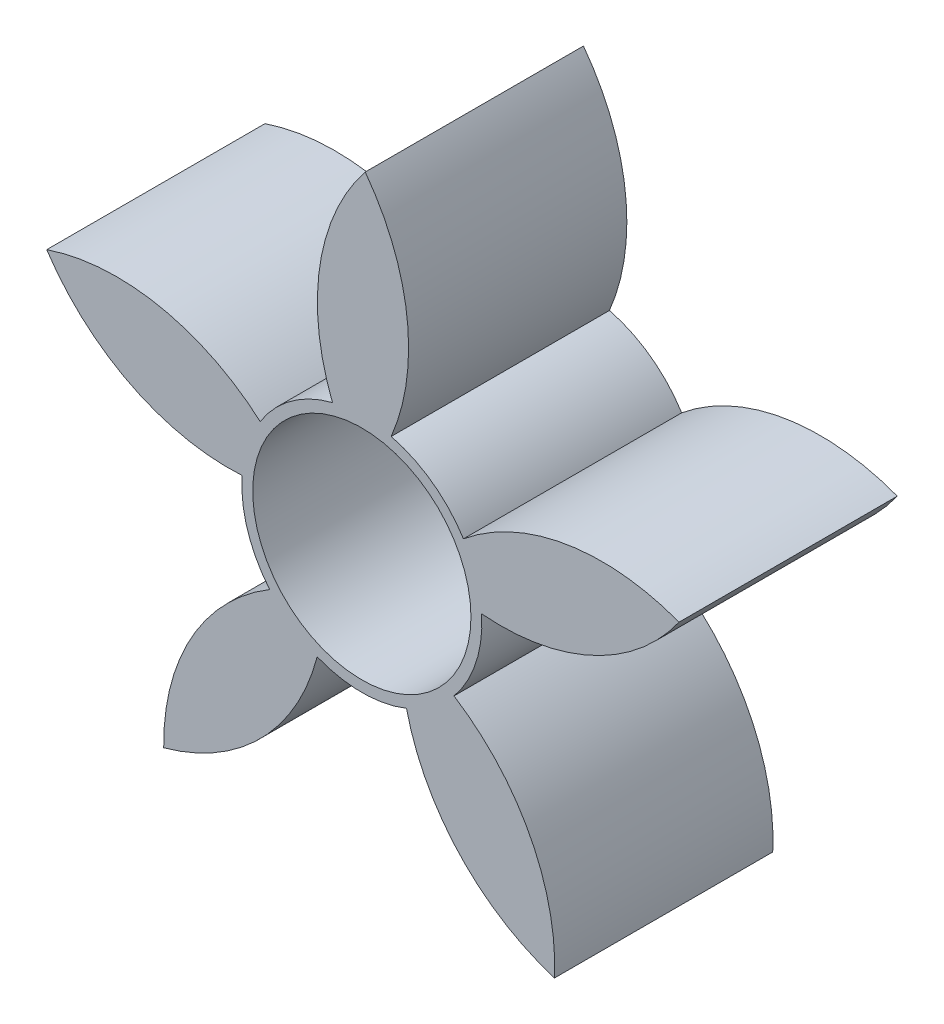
ISO-10303-21;
HEADER;
FILE_DESCRIPTION(('STEP AP214'),'2;1');
FILE_NAME('part.step','',(''),(''),'','','');
FILE_SCHEMA(('AUTOMOTIVE_DESIGN { 1 0 10303 214 1 1 1 1 }'));
ENDSEC;
DATA;
#1=APPLICATION_CONTEXT('core data for automotive mechanical design processes');
#2=APPLICATION_PROTOCOL_DEFINITION('international standard','automotive_design',2000,#1);
#3=PRODUCT_CONTEXT('',#1,'mechanical');
#4=PRODUCT('Part','Part','',(#3));
#5=PRODUCT_RELATED_PRODUCT_CATEGORY('part','',(#4));
#6=PRODUCT_DEFINITION_FORMATION('','',#4);
#7=PRODUCT_DEFINITION_CONTEXT('part definition',#1,'design');
#8=PRODUCT_DEFINITION('design','',#6,#7);
#9=PRODUCT_DEFINITION_SHAPE('','',#8);
#10=(LENGTH_UNIT() NAMED_UNIT(*) SI_UNIT(.MILLI.,.METRE.));
#11=(NAMED_UNIT(*) PLANE_ANGLE_UNIT() SI_UNIT($,.RADIAN.));
#12=(NAMED_UNIT(*) SI_UNIT($,.STERADIAN.) SOLID_ANGLE_UNIT());
#13=UNCERTAINTY_MEASURE_WITH_UNIT(LENGTH_MEASURE(1.E-05),#10,'distance_accuracy_value','');
#14=(GEOMETRIC_REPRESENTATION_CONTEXT(3) GLOBAL_UNCERTAINTY_ASSIGNED_CONTEXT((#13)) GLOBAL_UNIT_ASSIGNED_CONTEXT((#10,
#11,#12)) REPRESENTATION_CONTEXT('',''));
#15=CARTESIAN_POINT('',(0.,0.,0.));
#16=DIRECTION('',(0.,0.,1.));
#17=DIRECTION('',(1.,0.,0.));
#18=AXIS2_PLACEMENT_3D('',#15,#16,#17);
#19=CARTESIAN_POINT('',(0.136113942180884,23.1575869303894,25.4));
#20=DIRECTION('',(0.,0.,1.));
#21=DIRECTION('',(1.,0.,0.));
#22=AXIS2_PLACEMENT_3D('',#19,#20,#21);
#23=PLANE('',#22);
#24=CARTESIAN_POINT('',(-19.9560370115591,23.4904947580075,25.4));
#25=DIRECTION('',(0.,0.,1.));
#26=DIRECTION('',(1.,0.,0.));
#27=AXIS2_PLACEMENT_3D('',#24,#25,#26);
#28=CIRCLE('',#27,25.4);
#29=CARTESIAN_POINT('',(3.41625583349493,13.5458516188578,25.4));
#30=VERTEX_POINT('',#29);
#31=CARTESIAN_POINT('',(0.393488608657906,38.6910476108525,25.4));
#32=VERTEX_POINT('',#31);
#33=EDGE_CURVE('E200',#30,#32,#28,.T.);
#34=ORIENTED_EDGE('',*,*,#33,.T.);
#35=CARTESIAN_POINT('',(20.2282648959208,22.8246791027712,25.4));
#36=DIRECTION('',(0.,0.,1.));
#37=DIRECTION('',(1.,0.,0.));
#38=AXIS2_PLACEMENT_3D('',#35,#36,#37);
#39=CIRCLE('',#38,25.4);
#40=CARTESIAN_POINT('',(-3.41625583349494,13.5458516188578,25.4));
#41=VERTEX_POINT('',#40);
#42=EDGE_CURVE('E113',#32,#41,#39,.T.);
#43=ORIENTED_EDGE('',*,*,#42,.T.);
#44=CARTESIAN_POINT('',(0.,0.,25.4));
#45=DIRECTION('',(0.,0.,1.));
#46=DIRECTION('',(1.,0.,0.));
#47=AXIS2_PLACEMENT_3D('',#44,#45,#46);
#48=CIRCLE('',#47,13.97);
#49=CARTESIAN_POINT('',(-11.8271893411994,7.43495072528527,25.4));
#50=VERTEX_POINT('',#49);
#51=EDGE_CURVE('E236',#41,#50,#48,.T.);
#52=ORIENTED_EDGE('',*,*,#51,.T.);
#53=CARTESIAN_POINT('',(-28.5075426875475,-11.7203569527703,25.4));
#54=DIRECTION('',(0.,0.,1.));
#55=DIRECTION('',(1.,0.,0.));
#56=AXIS2_PLACEMENT_3D('',#53,#54,#55);
#57=CIRCLE('',#56,25.4);
#58=CARTESIAN_POINT('',(-36.6757782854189,12.3304211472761,25.4));
#59=VERTEX_POINT('',#58);
#60=EDGE_CURVE('E255',#50,#59,#57,.T.);
#61=ORIENTED_EDGE('',*,*,#60,.T.);
#62=CARTESIAN_POINT('',(-15.4566821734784,26.2914368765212,25.4));
#63=DIRECTION('',(0.,0.,1.));
#64=DIRECTION('',(1.,0.,0.));
#65=AXIS2_PLACEMENT_3D('',#62,#63,#64);
#66=CIRCLE('',#65,25.4);
#67=CARTESIAN_POINT('',(-13.9385515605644,0.936845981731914,25.4));
#68=VERTEX_POINT('',#67);
#69=EDGE_CURVE('E252',#59,#68,#66,.T.);
#70=ORIENTED_EDGE('',*,*,#69,.T.);
#71=CARTESIAN_POINT('',(0.,0.,25.4));
#72=DIRECTION('',(0.,0.,1.));
#73=DIRECTION('',(1.,0.,0.));
#74=AXIS2_PLACEMENT_3D('',#71,#72,#73);
#75=CIRCLE('',#74,13.97);
#76=CARTESIAN_POINT('',(-10.7258608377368,-8.95079936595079,25.4));
#77=VERTEX_POINT('',#76);
#78=EDGE_CURVE('E254',#68,#77,#75,.T.);
#79=ORIENTED_EDGE('',*,*,#78,.T.);
#80=CARTESIAN_POINT('',(2.33740669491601,-30.7340737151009,25.4));
#81=DIRECTION('',(0.,0.,1.));
#82=DIRECTION('',(1.,0.,0.));
#83=AXIS2_PLACEMENT_3D('',#80,#81,#82);
#84=CIRCLE('',#83,25.4);
#85=CARTESIAN_POINT('',(-23.0603661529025,-31.0704282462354,25.4));
#86=VERTEX_POINT('',#85);
#87=EDGE_CURVE('E257',#77,#86,#84,.T.);
#88=ORIENTED_EDGE('',*,*,#87,.T.);
#89=CARTESIAN_POINT('',(-29.7810198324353,-6.57567750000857,25.4));
#90=DIRECTION('',(0.,0.,1.));
#91=DIRECTION('',(1.,0.,0.));
#92=AXIS2_PLACEMENT_3D('',#89,#90,#91);
#93=CIRCLE('',#92,25.4);
#94=CARTESIAN_POINT('',(-5.19824278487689,-12.9668489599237,25.4));
#95=VERTEX_POINT('',#94);
#96=EDGE_CURVE('E263',#86,#95,#93,.T.);
#97=ORIENTED_EDGE('',*,*,#96,.T.);
#98=CARTESIAN_POINT('',(0.,0.,25.4));
#99=DIRECTION('',(0.,0.,1.));
#100=DIRECTION('',(1.,0.,0.));
#101=AXIS2_PLACEMENT_3D('',#98,#99,#100);
#102=CIRCLE('',#101,13.97);
#103=CARTESIAN_POINT('',(5.1982427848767,-12.9668489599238,25.4));
#104=VERTEX_POINT('',#103);
#105=EDGE_CURVE('E265',#95,#104,#102,.T.);
#106=ORIENTED_EDGE('',*,*,#105,.T.);
#107=CARTESIAN_POINT('',(29.9521394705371,-7.27434521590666,25.4));
#108=DIRECTION('',(0.,0.,1.));
#109=DIRECTION('',(1.,0.,0.));
#110=AXIS2_PLACEMENT_3D('',#107,#108,#109);
#111=CIRCLE('',#110,25.4);
#112=CARTESIAN_POINT('',(22.4236882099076,-31.5330018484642,25.4));
#113=VERTEX_POINT('',#112);
#114=EDGE_CURVE('E267',#104,#113,#111,.T.);
#115=ORIENTED_EDGE('',*,*,#114,.T.);
#116=CARTESIAN_POINT('',(-2.94900030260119,-30.3554290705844,25.4));
#117=DIRECTION('',(0.,0.,1.));
#118=DIRECTION('',(1.,0.,0.));
#119=AXIS2_PLACEMENT_3D('',#116,#117,#118);
#120=CIRCLE('',#119,25.4);
#121=CARTESIAN_POINT('',(10.7258608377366,-8.95079936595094,25.4));
#122=VERTEX_POINT('',#121);
#123=EDGE_CURVE('E269',#113,#122,#120,.T.);
#124=ORIENTED_EDGE('',*,*,#123,.T.);
#125=CARTESIAN_POINT('',(0.,0.,25.4));
#126=DIRECTION('',(0.,0.,1.));
#127=DIRECTION('',(1.,0.,0.));
#128=AXIS2_PLACEMENT_3D('',#125,#126,#127);
#129=CIRCLE('',#128,13.97);
#130=CARTESIAN_POINT('',(13.9385515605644,0.936845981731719,25.4));
#131=VERTEX_POINT('',#130);
#132=EDGE_CURVE('E153',#122,#131,#129,.T.);
#133=ORIENTED_EDGE('',*,*,#132,.T.);
#134=CARTESIAN_POINT('',(16.1740335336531,26.2382811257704,25.4));
#135=DIRECTION('',(0.,0.,1.));
#136=DIRECTION('',(1.,0.,0.));
#137=AXIS2_PLACEMENT_3D('',#134,#135,#136);
#138=CIRCLE('',#137,25.4);
#139=CARTESIAN_POINT('',(36.9189676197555,11.5819613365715,25.4));
#140=VERTEX_POINT('',#139);
#141=EDGE_CURVE('E147',#131,#140,#138,.T.);
#142=ORIENTED_EDGE('',*,*,#141,.T.);
#143=CARTESIAN_POINT('',(27.9584374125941,-12.1850094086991,25.4));
#144=DIRECTION('',(0.,0.,1.));
#145=DIRECTION('',(1.,0.,0.));
#146=AXIS2_PLACEMENT_3D('',#143,#144,#145);
#147=CIRCLE('',#146,25.4);
#148=CARTESIAN_POINT('',(11.8271893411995,7.4349507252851,25.4));
#149=VERTEX_POINT('',#148);
#150=EDGE_CURVE('E151',#140,#149,#147,.T.);
#151=ORIENTED_EDGE('',*,*,#150,.T.);
#152=CARTESIAN_POINT('',(0.,0.,25.4));
#153=DIRECTION('',(0.,0.,1.));
#154=DIRECTION('',(1.,0.,0.));
#155=AXIS2_PLACEMENT_3D('',#152,#153,#154);
#156=CIRCLE('',#155,13.97);
#157=EDGE_CURVE('E49',#149,#30,#156,.T.);
#158=ORIENTED_EDGE('',*,*,#157,.T.);
#159=EDGE_LOOP('',(#34,#43,#52,#61,#70,#79,#88,#97,#106,#115,#124,#133,#142,#151,#158));
#160=FACE_BOUND('',#159,.T.);
#161=CARTESIAN_POINT('',(0.,0.,25.4));
#162=DIRECTION('',(0.,0.,1.));
#163=DIRECTION('',(1.,0.,0.));
#164=AXIS2_PLACEMENT_3D('',#161,#162,#163);
#165=CIRCLE('',#164,12.7);
#166=CARTESIAN_POINT('',(12.7,0.,25.4));
#167=VERTEX_POINT('',#166);
#168=EDGE_CURVE('E175',#167,#167,#165,.T.);
#169=ORIENTED_EDGE('',*,*,#168,.F.);
#170=EDGE_LOOP('',(#169));
#171=FACE_BOUND('',#170,.T.);
#172=ADVANCED_FACE('F32',(#160,#171),#23,.T.);
#173=CARTESIAN_POINT('',(0.136113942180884,23.1575869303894,0.));
#174=DIRECTION('',(0.,0.,1.));
#175=DIRECTION('',(1.,0.,0.));
#176=AXIS2_PLACEMENT_3D('',#173,#174,#175);
#177=PLANE('',#176);
#178=CARTESIAN_POINT('',(-19.9560370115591,23.4904947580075,0.));
#179=DIRECTION('',(0.,0.,1.));
#180=DIRECTION('',(1.,0.,0.));
#181=AXIS2_PLACEMENT_3D('',#178,#179,#180);
#182=CIRCLE('',#181,25.4);
#183=CARTESIAN_POINT('',(3.41625583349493,13.5458516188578,0.));
#184=VERTEX_POINT('',#183);
#185=CARTESIAN_POINT('',(0.393488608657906,38.6910476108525,0.));
#186=VERTEX_POINT('',#185);
#187=EDGE_CURVE('E171',#184,#186,#182,.T.);
#188=ORIENTED_EDGE('',*,*,#187,.F.);
#189=CARTESIAN_POINT('',(0.,0.,0.));
#190=DIRECTION('',(0.,0.,1.));
#191=DIRECTION('',(1.,0.,0.));
#192=AXIS2_PLACEMENT_3D('',#189,#190,#191);
#193=CIRCLE('',#192,13.97);
#194=CARTESIAN_POINT('',(11.8271893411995,7.4349507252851,0.));
#195=VERTEX_POINT('',#194);
#196=EDGE_CURVE('E105',#195,#184,#193,.T.);
#197=ORIENTED_EDGE('',*,*,#196,.F.);
#198=CARTESIAN_POINT('',(27.9584374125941,-12.1850094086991,0.));
#199=DIRECTION('',(0.,0.,1.));
#200=DIRECTION('',(1.,0.,0.));
#201=AXIS2_PLACEMENT_3D('',#198,#199,#200);
#202=CIRCLE('',#201,25.4);
#203=CARTESIAN_POINT('',(36.9189676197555,11.5819613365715,0.));
#204=VERTEX_POINT('',#203);
#205=EDGE_CURVE('E99',#204,#195,#202,.T.);
#206=ORIENTED_EDGE('',*,*,#205,.F.);
#207=CARTESIAN_POINT('',(16.1740335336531,26.2382811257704,0.));
#208=DIRECTION('',(0.,0.,1.));
#209=DIRECTION('',(1.,0.,0.));
#210=AXIS2_PLACEMENT_3D('',#207,#208,#209);
#211=CIRCLE('',#210,25.4);
#212=CARTESIAN_POINT('',(13.9385515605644,0.936845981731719,0.));
#213=VERTEX_POINT('',#212);
#214=EDGE_CURVE('E161',#213,#204,#211,.T.);
#215=ORIENTED_EDGE('',*,*,#214,.F.);
#216=CARTESIAN_POINT('',(0.,0.,0.));
#217=DIRECTION('',(0.,0.,1.));
#218=DIRECTION('',(1.,0.,0.));
#219=AXIS2_PLACEMENT_3D('',#216,#217,#218);
#220=CIRCLE('',#219,13.97);
#221=CARTESIAN_POINT('',(10.7258608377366,-8.95079936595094,0.));
#222=VERTEX_POINT('',#221);
#223=EDGE_CURVE('E195',#222,#213,#220,.T.);
#224=ORIENTED_EDGE('',*,*,#223,.F.);
#225=CARTESIAN_POINT('',(-2.94900030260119,-30.3554290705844,0.));
#226=DIRECTION('',(0.,0.,1.));
#227=DIRECTION('',(1.,0.,0.));
#228=AXIS2_PLACEMENT_3D('',#225,#226,#227);
#229=CIRCLE('',#228,25.4);
#230=CARTESIAN_POINT('',(22.4236882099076,-31.5330018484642,0.));
#231=VERTEX_POINT('',#230);
#232=EDGE_CURVE('E193',#231,#222,#229,.T.);
#233=ORIENTED_EDGE('',*,*,#232,.F.);
#234=CARTESIAN_POINT('',(29.9521394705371,-7.27434521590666,0.));
#235=DIRECTION('',(0.,0.,1.));
#236=DIRECTION('',(1.,0.,0.));
#237=AXIS2_PLACEMENT_3D('',#234,#235,#236);
#238=CIRCLE('',#237,25.4);
#239=CARTESIAN_POINT('',(5.1982427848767,-12.9668489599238,0.));
#240=VERTEX_POINT('',#239);
#241=EDGE_CURVE('E191',#240,#231,#238,.T.);
#242=ORIENTED_EDGE('',*,*,#241,.F.);
#243=CARTESIAN_POINT('',(0.,0.,0.));
#244=DIRECTION('',(0.,0.,1.));
#245=DIRECTION('',(1.,0.,0.));
#246=AXIS2_PLACEMENT_3D('',#243,#244,#245);
#247=CIRCLE('',#246,13.97);
#248=CARTESIAN_POINT('',(-5.19824278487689,-12.9668489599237,0.));
#249=VERTEX_POINT('',#248);
#250=EDGE_CURVE('E189',#249,#240,#247,.T.);
#251=ORIENTED_EDGE('',*,*,#250,.F.);
#252=CARTESIAN_POINT('',(-29.7810198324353,-6.57567750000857,0.));
#253=DIRECTION('',(0.,0.,1.));
#254=DIRECTION('',(1.,0.,0.));
#255=AXIS2_PLACEMENT_3D('',#252,#253,#254);
#256=CIRCLE('',#255,25.4);
#257=CARTESIAN_POINT('',(-23.0603661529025,-31.0704282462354,0.));
#258=VERTEX_POINT('',#257);
#259=EDGE_CURVE('E187',#258,#249,#256,.T.);
#260=ORIENTED_EDGE('',*,*,#259,.F.);
#261=CARTESIAN_POINT('',(2.33740669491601,-30.7340737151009,0.));
#262=DIRECTION('',(0.,0.,1.));
#263=DIRECTION('',(1.,0.,0.));
#264=AXIS2_PLACEMENT_3D('',#261,#262,#263);
#265=CIRCLE('',#264,25.4);
#266=CARTESIAN_POINT('',(-10.7258608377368,-8.95079936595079,0.));
#267=VERTEX_POINT('',#266);
#268=EDGE_CURVE('E185',#267,#258,#265,.T.);
#269=ORIENTED_EDGE('',*,*,#268,.F.);
#270=CARTESIAN_POINT('',(0.,0.,0.));
#271=DIRECTION('',(0.,0.,1.));
#272=DIRECTION('',(1.,0.,0.));
#273=AXIS2_PLACEMENT_3D('',#270,#271,#272);
#274=CIRCLE('',#273,13.97);
#275=CARTESIAN_POINT('',(-13.9385515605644,0.936845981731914,0.));
#276=VERTEX_POINT('',#275);
#277=EDGE_CURVE('E183',#276,#267,#274,.T.);
#278=ORIENTED_EDGE('',*,*,#277,.F.);
#279=CARTESIAN_POINT('',(-15.4566821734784,26.2914368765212,0.));
#280=DIRECTION('',(0.,0.,1.));
#281=DIRECTION('',(1.,0.,0.));
#282=AXIS2_PLACEMENT_3D('',#279,#280,#281);
#283=CIRCLE('',#282,25.4);
#284=CARTESIAN_POINT('',(-36.6757782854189,12.3304211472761,0.));
#285=VERTEX_POINT('',#284);
#286=EDGE_CURVE('E181',#285,#276,#283,.T.);
#287=ORIENTED_EDGE('',*,*,#286,.F.);
#288=CARTESIAN_POINT('',(-28.5075426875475,-11.7203569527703,0.));
#289=DIRECTION('',(0.,0.,1.));
#290=DIRECTION('',(1.,0.,0.));
#291=AXIS2_PLACEMENT_3D('',#288,#289,#290);
#292=CIRCLE('',#291,25.4);
#293=CARTESIAN_POINT('',(-11.8271893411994,7.43495072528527,0.));
#294=VERTEX_POINT('',#293);
#295=EDGE_CURVE('E179',#294,#285,#292,.T.);
#296=ORIENTED_EDGE('',*,*,#295,.F.);
#297=CARTESIAN_POINT('',(0.,0.,0.));
#298=DIRECTION('',(0.,0.,1.));
#299=DIRECTION('',(1.,0.,0.));
#300=AXIS2_PLACEMENT_3D('',#297,#298,#299);
#301=CIRCLE('',#300,13.97);
#302=CARTESIAN_POINT('',(-3.41625583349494,13.5458516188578,0.));
#303=VERTEX_POINT('',#302);
#304=EDGE_CURVE('E177',#303,#294,#301,.T.);
#305=ORIENTED_EDGE('',*,*,#304,.F.);
#306=CARTESIAN_POINT('',(20.2282648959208,22.8246791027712,0.));
#307=DIRECTION('',(0.,0.,1.));
#308=DIRECTION('',(1.,0.,0.));
#309=AXIS2_PLACEMENT_3D('',#306,#307,#308);
#310=CIRCLE('',#309,25.4);
#311=EDGE_CURVE('E174',#186,#303,#310,.T.);
#312=ORIENTED_EDGE('',*,*,#311,.F.);
#313=EDGE_LOOP('',(#188,#197,#206,#215,#224,#233,#242,#251,#260,#269,#278,#287,#296,#305,#312));
#314=FACE_BOUND('',#313,.T.);
#315=CARTESIAN_POINT('',(0.,0.,0.));
#316=DIRECTION('',(0.,0.,1.));
#317=DIRECTION('',(1.,0.,0.));
#318=AXIS2_PLACEMENT_3D('',#315,#316,#317);
#319=CIRCLE('',#318,12.7);
#320=CARTESIAN_POINT('',(12.7,0.,0.));
#321=VERTEX_POINT('',#320);
#322=EDGE_CURVE('E455',#321,#321,#319,.T.);
#323=ORIENTED_EDGE('',*,*,#322,.T.);
#324=EDGE_LOOP('',(#323));
#325=FACE_BOUND('',#324,.T.);
#326=ADVANCED_FACE('F240',(#314,#325),#177,.F.);
#327=CARTESIAN_POINT('',(-19.9560370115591,23.4904947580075,25.4));
#328=DIRECTION('',(0.,0.,-1.));
#329=DIRECTION('',(-1.,0.,0.));
#330=AXIS2_PLACEMENT_3D('',#327,#328,#329);
#331=CYLINDRICAL_SURFACE('',#330,25.4);
#332=ORIENTED_EDGE('',*,*,#187,.T.);
#333=DIRECTION('',(0.,0.,-1.));
#334=VECTOR('',#333,1.);
#335=CARTESIAN_POINT('',(0.393488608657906,38.6910476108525,25.4));
#336=LINE('',#335,#334);
#337=EDGE_CURVE('E11',#32,#186,#336,.T.);
#338=ORIENTED_EDGE('',*,*,#337,.F.);
#339=ORIENTED_EDGE('',*,*,#33,.F.);
#340=DIRECTION('',(0.,0.,-1.));
#341=VECTOR('',#340,1.);
#342=CARTESIAN_POINT('',(3.41625583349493,13.5458516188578,25.4));
#343=LINE('',#342,#341);
#344=EDGE_CURVE('E167',#30,#184,#343,.T.);
#345=ORIENTED_EDGE('',*,*,#344,.T.);
#346=EDGE_LOOP('',(#332,#338,#339,#345));
#347=FACE_BOUND('',#346,.T.);
#348=ADVANCED_FACE('F34',(#347),#331,.T.);
#349=CARTESIAN_POINT('',(20.2282648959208,22.8246791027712,25.4));
#350=DIRECTION('',(0.,0.,-1.));
#351=DIRECTION('',(-1.,0.,0.));
#352=AXIS2_PLACEMENT_3D('',#349,#350,#351);
#353=CYLINDRICAL_SURFACE('',#352,25.4);
#354=ORIENTED_EDGE('',*,*,#311,.T.);
#355=DIRECTION('',(0.,0.,-1.));
#356=VECTOR('',#355,1.);
#357=CARTESIAN_POINT('',(-3.41625583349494,13.5458516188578,25.4));
#358=LINE('',#357,#356);
#359=EDGE_CURVE('E41',#41,#303,#358,.T.);
#360=ORIENTED_EDGE('',*,*,#359,.F.);
#361=ORIENTED_EDGE('',*,*,#42,.F.);
#362=ORIENTED_EDGE('',*,*,#337,.T.);
#363=EDGE_LOOP('',(#354,#360,#361,#362));
#364=FACE_BOUND('',#363,.T.);
#365=ADVANCED_FACE('F303',(#364),#353,.T.);
#366=CARTESIAN_POINT('',(0.,0.,25.4));
#367=DIRECTION('',(0.,0.,-1.));
#368=DIRECTION('',(-1.,0.,0.));
#369=AXIS2_PLACEMENT_3D('',#366,#367,#368);
#370=CYLINDRICAL_SURFACE('',#369,13.97);
#371=ORIENTED_EDGE('',*,*,#304,.T.);
#372=DIRECTION('',(0.,0.,-1.));
#373=VECTOR('',#372,1.);
#374=CARTESIAN_POINT('',(-11.8271893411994,7.43495072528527,25.4));
#375=LINE('',#374,#373);
#376=EDGE_CURVE('E228',#50,#294,#375,.T.);
#377=ORIENTED_EDGE('',*,*,#376,.F.);
#378=ORIENTED_EDGE('',*,*,#51,.F.);
#379=ORIENTED_EDGE('',*,*,#359,.T.);
#380=EDGE_LOOP('',(#371,#377,#378,#379));
#381=FACE_BOUND('',#380,.T.);
#382=ADVANCED_FACE('F234',(#381),#370,.T.);
#383=CARTESIAN_POINT('',(-28.5075426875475,-11.7203569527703,25.4));
#384=DIRECTION('',(0.,0.,-1.));
#385=DIRECTION('',(-1.,0.,0.));
#386=AXIS2_PLACEMENT_3D('',#383,#384,#385);
#387=CYLINDRICAL_SURFACE('',#386,25.4);
#388=ORIENTED_EDGE('',*,*,#295,.T.);
#389=DIRECTION('',(0.,0.,-1.));
#390=VECTOR('',#389,1.);
#391=CARTESIAN_POINT('',(-36.6757782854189,12.3304211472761,25.4));
#392=LINE('',#391,#390);
#393=EDGE_CURVE('E225',#59,#285,#392,.T.);
#394=ORIENTED_EDGE('',*,*,#393,.F.);
#395=ORIENTED_EDGE('',*,*,#60,.F.);
#396=ORIENTED_EDGE('',*,*,#376,.T.);
#397=EDGE_LOOP('',(#388,#394,#395,#396));
#398=FACE_BOUND('',#397,.T.);
#399=ADVANCED_FACE('F246',(#398),#387,.T.);
#400=CARTESIAN_POINT('',(-15.4566821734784,26.2914368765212,25.4));
#401=DIRECTION('',(0.,0.,-1.));
#402=DIRECTION('',(-1.,0.,0.));
#403=AXIS2_PLACEMENT_3D('',#400,#401,#402);
#404=CYLINDRICAL_SURFACE('',#403,25.4);
#405=ORIENTED_EDGE('',*,*,#286,.T.);
#406=DIRECTION('',(0.,0.,-1.));
#407=VECTOR('',#406,1.);
#408=CARTESIAN_POINT('',(-13.9385515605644,0.936845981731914,25.4));
#409=LINE('',#408,#407);
#410=EDGE_CURVE('E222',#68,#276,#409,.T.);
#411=ORIENTED_EDGE('',*,*,#410,.F.);
#412=ORIENTED_EDGE('',*,*,#69,.F.);
#413=ORIENTED_EDGE('',*,*,#393,.T.);
#414=EDGE_LOOP('',(#405,#411,#412,#413));
#415=FACE_BOUND('',#414,.T.);
#416=ADVANCED_FACE('F250',(#415),#404,.T.);
#417=CARTESIAN_POINT('',(0.,0.,25.4));
#418=DIRECTION('',(0.,0.,-1.));
#419=DIRECTION('',(-1.,0.,0.));
#420=AXIS2_PLACEMENT_3D('',#417,#418,#419);
#421=CYLINDRICAL_SURFACE('',#420,13.97);
#422=ORIENTED_EDGE('',*,*,#277,.T.);
#423=DIRECTION('',(0.,0.,-1.));
#424=VECTOR('',#423,1.);
#425=CARTESIAN_POINT('',(-10.7258608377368,-8.95079936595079,25.4));
#426=LINE('',#425,#424);
#427=EDGE_CURVE('E219',#77,#267,#426,.T.);
#428=ORIENTED_EDGE('',*,*,#427,.F.);
#429=ORIENTED_EDGE('',*,*,#78,.F.);
#430=ORIENTED_EDGE('',*,*,#410,.T.);
#431=EDGE_LOOP('',(#422,#428,#429,#430));
#432=FACE_BOUND('',#431,.T.);
#433=ADVANCED_FACE('F316',(#432),#421,.T.);
#434=CARTESIAN_POINT('',(2.33740669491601,-30.7340737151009,25.4));
#435=DIRECTION('',(0.,0.,-1.));
#436=DIRECTION('',(-1.,0.,0.));
#437=AXIS2_PLACEMENT_3D('',#434,#435,#436);
#438=CYLINDRICAL_SURFACE('',#437,25.4);
#439=ORIENTED_EDGE('',*,*,#268,.T.);
#440=DIRECTION('',(0.,0.,-1.));
#441=VECTOR('',#440,1.);
#442=CARTESIAN_POINT('',(-23.0603661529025,-31.0704282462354,25.4));
#443=LINE('',#442,#441);
#444=EDGE_CURVE('E216',#86,#258,#443,.T.);
#445=ORIENTED_EDGE('',*,*,#444,.F.);
#446=ORIENTED_EDGE('',*,*,#87,.F.);
#447=ORIENTED_EDGE('',*,*,#427,.T.);
#448=EDGE_LOOP('',(#439,#445,#446,#447));
#449=FACE_BOUND('',#448,.T.);
#450=ADVANCED_FACE('F319',(#449),#438,.T.);
#451=CARTESIAN_POINT('',(-29.7810198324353,-6.57567750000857,25.4));
#452=DIRECTION('',(0.,0.,-1.));
#453=DIRECTION('',(-1.,0.,0.));
#454=AXIS2_PLACEMENT_3D('',#451,#452,#453);
#455=CYLINDRICAL_SURFACE('',#454,25.4);
#456=ORIENTED_EDGE('',*,*,#259,.T.);
#457=DIRECTION('',(0.,0.,-1.));
#458=VECTOR('',#457,1.);
#459=CARTESIAN_POINT('',(-5.19824278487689,-12.9668489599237,25.4));
#460=LINE('',#459,#458);
#461=EDGE_CURVE('E213',#95,#249,#460,.T.);
#462=ORIENTED_EDGE('',*,*,#461,.F.);
#463=ORIENTED_EDGE('',*,*,#96,.F.);
#464=ORIENTED_EDGE('',*,*,#444,.T.);
#465=EDGE_LOOP('',(#456,#462,#463,#464));
#466=FACE_BOUND('',#465,.T.);
#467=ADVANCED_FACE('F323',(#466),#455,.T.);
#468=CARTESIAN_POINT('',(0.,0.,25.4));
#469=DIRECTION('',(0.,0.,-1.));
#470=DIRECTION('',(-1.,0.,0.));
#471=AXIS2_PLACEMENT_3D('',#468,#469,#470);
#472=CYLINDRICAL_SURFACE('',#471,13.97);
#473=ORIENTED_EDGE('',*,*,#250,.T.);
#474=DIRECTION('',(0.,0.,-1.));
#475=VECTOR('',#474,1.);
#476=CARTESIAN_POINT('',(5.1982427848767,-12.9668489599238,25.4));
#477=LINE('',#476,#475);
#478=EDGE_CURVE('E210',#104,#240,#477,.T.);
#479=ORIENTED_EDGE('',*,*,#478,.F.);
#480=ORIENTED_EDGE('',*,*,#105,.F.);
#481=ORIENTED_EDGE('',*,*,#461,.T.);
#482=EDGE_LOOP('',(#473,#479,#480,#481));
#483=FACE_BOUND('',#482,.T.);
#484=ADVANCED_FACE('F327',(#483),#472,.T.);
#485=CARTESIAN_POINT('',(29.9521394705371,-7.27434521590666,25.4));
#486=DIRECTION('',(0.,0.,-1.));
#487=DIRECTION('',(-1.,0.,0.));
#488=AXIS2_PLACEMENT_3D('',#485,#486,#487);
#489=CYLINDRICAL_SURFACE('',#488,25.4);
#490=ORIENTED_EDGE('',*,*,#241,.T.);
#491=DIRECTION('',(0.,0.,-1.));
#492=VECTOR('',#491,1.);
#493=CARTESIAN_POINT('',(22.4236882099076,-31.5330018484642,25.4));
#494=LINE('',#493,#492);
#495=EDGE_CURVE('E207',#113,#231,#494,.T.);
#496=ORIENTED_EDGE('',*,*,#495,.F.);
#497=ORIENTED_EDGE('',*,*,#114,.F.);
#498=ORIENTED_EDGE('',*,*,#478,.T.);
#499=EDGE_LOOP('',(#490,#496,#497,#498));
#500=FACE_BOUND('',#499,.T.);
#501=ADVANCED_FACE('F331',(#500),#489,.T.);
#502=CARTESIAN_POINT('',(-2.94900030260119,-30.3554290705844,25.4));
#503=DIRECTION('',(0.,0.,-1.));
#504=DIRECTION('',(-1.,0.,0.));
#505=AXIS2_PLACEMENT_3D('',#502,#503,#504);
#506=CYLINDRICAL_SURFACE('',#505,25.4);
#507=ORIENTED_EDGE('',*,*,#232,.T.);
#508=DIRECTION('',(0.,0.,-1.));
#509=VECTOR('',#508,1.);
#510=CARTESIAN_POINT('',(10.7258608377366,-8.95079936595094,25.4));
#511=LINE('',#510,#509);
#512=EDGE_CURVE('E204',#122,#222,#511,.T.);
#513=ORIENTED_EDGE('',*,*,#512,.F.);
#514=ORIENTED_EDGE('',*,*,#123,.F.);
#515=ORIENTED_EDGE('',*,*,#495,.T.);
#516=EDGE_LOOP('',(#507,#513,#514,#515));
#517=FACE_BOUND('',#516,.T.);
#518=ADVANCED_FACE('F275',(#517),#506,.T.);
#519=CARTESIAN_POINT('',(0.,0.,25.4));
#520=DIRECTION('',(0.,0.,-1.));
#521=DIRECTION('',(-1.,0.,0.));
#522=AXIS2_PLACEMENT_3D('',#519,#520,#521);
#523=CYLINDRICAL_SURFACE('',#522,13.97);
#524=ORIENTED_EDGE('',*,*,#223,.T.);
#525=DIRECTION('',(0.,0.,-1.));
#526=VECTOR('',#525,1.);
#527=CARTESIAN_POINT('',(13.9385515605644,0.936845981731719,25.4));
#528=LINE('',#527,#526);
#529=EDGE_CURVE('E162',#131,#213,#528,.T.);
#530=ORIENTED_EDGE('',*,*,#529,.F.);
#531=ORIENTED_EDGE('',*,*,#132,.F.);
#532=ORIENTED_EDGE('',*,*,#512,.T.);
#533=EDGE_LOOP('',(#524,#530,#531,#532));
#534=FACE_BOUND('',#533,.T.);
#535=ADVANCED_FACE('F279',(#534),#523,.T.);
#536=CARTESIAN_POINT('',(16.1740335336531,26.2382811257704,25.4));
#537=DIRECTION('',(0.,0.,-1.));
#538=DIRECTION('',(-1.,0.,0.));
#539=AXIS2_PLACEMENT_3D('',#536,#537,#538);
#540=CYLINDRICAL_SURFACE('',#539,25.4);
#541=ORIENTED_EDGE('',*,*,#214,.T.);
#542=DIRECTION('',(0.,0.,-1.));
#543=VECTOR('',#542,1.);
#544=CARTESIAN_POINT('',(36.9189676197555,11.5819613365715,25.4));
#545=LINE('',#544,#543);
#546=EDGE_CURVE('E158',#140,#204,#545,.T.);
#547=ORIENTED_EDGE('',*,*,#546,.F.);
#548=ORIENTED_EDGE('',*,*,#141,.F.);
#549=ORIENTED_EDGE('',*,*,#529,.T.);
#550=EDGE_LOOP('',(#541,#547,#548,#549));
#551=FACE_BOUND('',#550,.T.);
#552=ADVANCED_FACE('F159',(#551),#540,.T.);
#553=CARTESIAN_POINT('',(27.9584374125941,-12.1850094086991,25.4));
#554=DIRECTION('',(0.,0.,-1.));
#555=DIRECTION('',(-1.,0.,0.));
#556=AXIS2_PLACEMENT_3D('',#553,#554,#555);
#557=CYLINDRICAL_SURFACE('',#556,25.4);
#558=ORIENTED_EDGE('',*,*,#205,.T.);
#559=DIRECTION('',(0.,0.,-1.));
#560=VECTOR('',#559,1.);
#561=CARTESIAN_POINT('',(11.8271893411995,7.4349507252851,25.4));
#562=LINE('',#561,#560);
#563=EDGE_CURVE('E163',#149,#195,#562,.T.);
#564=ORIENTED_EDGE('',*,*,#563,.F.);
#565=ORIENTED_EDGE('',*,*,#150,.F.);
#566=ORIENTED_EDGE('',*,*,#546,.T.);
#567=EDGE_LOOP('',(#558,#564,#565,#566));
#568=FACE_BOUND('',#567,.T.);
#569=ADVANCED_FACE('F165',(#568),#557,.T.);
#570=CARTESIAN_POINT('',(0.,0.,25.4));
#571=DIRECTION('',(0.,0.,-1.));
#572=DIRECTION('',(-1.,0.,0.));
#573=AXIS2_PLACEMENT_3D('',#570,#571,#572);
#574=CYLINDRICAL_SURFACE('',#573,13.97);
#575=ORIENTED_EDGE('',*,*,#196,.T.);
#576=ORIENTED_EDGE('',*,*,#344,.F.);
#577=ORIENTED_EDGE('',*,*,#157,.F.);
#578=ORIENTED_EDGE('',*,*,#563,.T.);
#579=EDGE_LOOP('',(#575,#576,#577,#578));
#580=FACE_BOUND('',#579,.T.);
#581=ADVANCED_FACE('F283',(#580),#574,.T.);
#582=CARTESIAN_POINT('',(0.,0.,25.4));
#583=DIRECTION('',(0.,0.,-1.));
#584=DIRECTION('',(-1.,0.,0.));
#585=AXIS2_PLACEMENT_3D('',#582,#583,#584);
#586=CYLINDRICAL_SURFACE('',#585,12.7);
#587=ORIENTED_EDGE('',*,*,#168,.T.);
#588=EDGE_LOOP('',(#587));
#589=FACE_BOUND('',#588,.T.);
#590=ORIENTED_EDGE('',*,*,#322,.F.);
#591=EDGE_LOOP('',(#590));
#592=FACE_BOUND('',#591,.T.);
#593=ADVANCED_FACE('F285',(#589,#592),#586,.F.);
#594=CLOSED_SHELL('',(#172,#326,#348,#365,#382,#399,#416,#433,#450,#467,#484,#501,#518,#535,
#552,#569,#581,#593));
#595=MANIFOLD_SOLID_BREP('B2',#594);
#596=ADVANCED_BREP_SHAPE_REPRESENTATION('',(#18,#595),#14);
#597=SHAPE_DEFINITION_REPRESENTATION(#9,#596);
ENDSEC;
END-ISO-10303-21;
